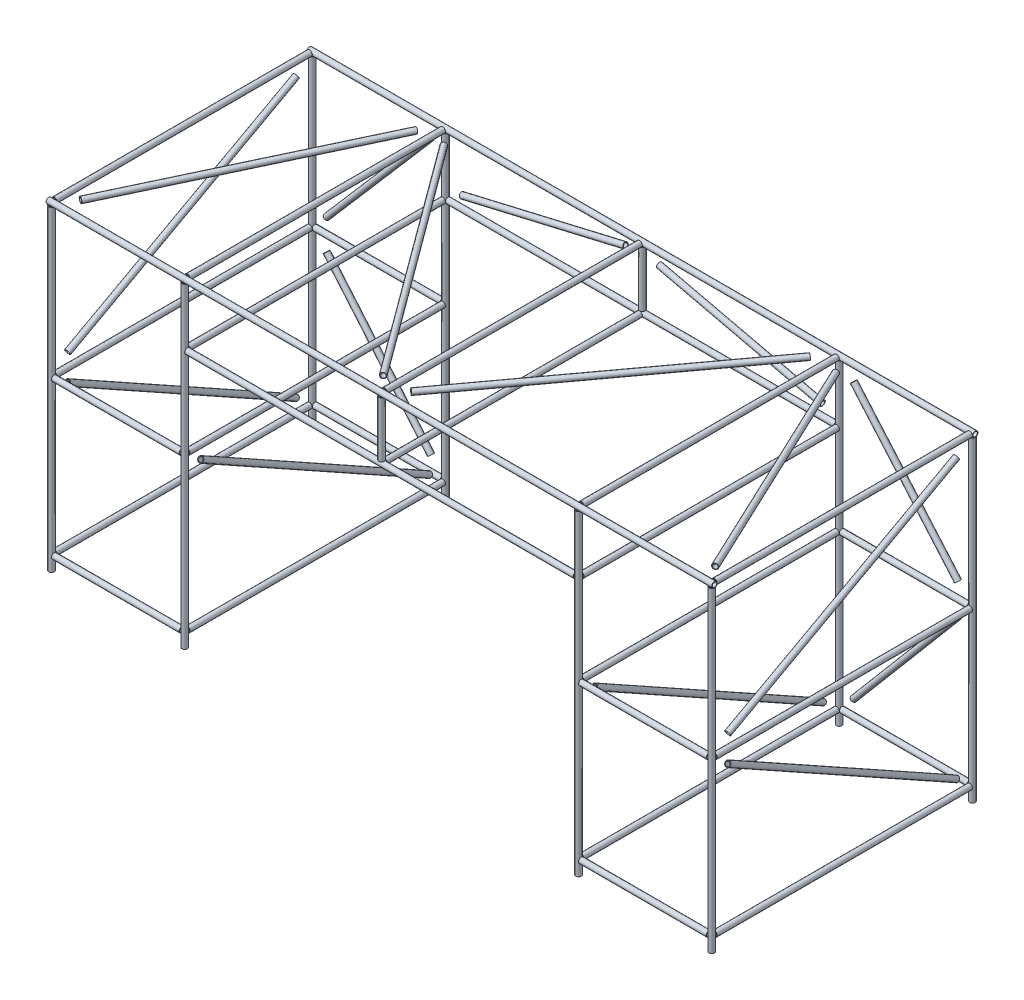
from build123d import *

# Parameters (mm, degrees)
SKETCH1_R                   = 6.35
SKETCH1_R_2                 = 5.08
STRUCTURAL_MEMBER1_DEPTH    = 1524
SKETCH1_ON_SEGMENT_2_R      = 6.35
SKETCH1_ON_SEGMENT_2_R_2    = 5.08
STRUCTURAL_MEMBER1_2_DEPTH  = 1524
SKETCH11_R                  = 6.35
SKETCH11_R_2                = 5.08
STRUCTURAL_MEMBER2_DEPTH    = 584.2
SKETCH11_ON_SEGMENT_2_R     = 6.35
SKETCH11_ON_SEGMENT_2_R_2   = 5.08
STRUCTURAL_MEMBER2_2_DEPTH  = 584.2
SKETCH11_ON_SEGMENT_3_R     = 6.35
SKETCH11_ON_SEGMENT_3_R_2   = 5.08
STRUCTURAL_MEMBER2_3_DEPTH  = 584.2
SKETCH11_ON_SEGMENT_4_R     = 6.35
SKETCH11_ON_SEGMENT_4_R_2   = 5.08
STRUCTURAL_MEMBER2_4_DEPTH  = 584.2
SKETCH11_ON_SEGMENT_5_R     = 6.35
SKETCH11_ON_SEGMENT_5_R_2   = 5.08
STRUCTURAL_MEMBER2_5_DEPTH  = 584.2
TOP_COUNT                   = 2
TOP_PITCH                   = 139.7
SKETCH110_R                 = 6.35
SKETCH110_R_2               = 5.08
STRUCTURAL_MEMBER7_DEPTH    = 889
SKETCH110_ON_SEGMENT_2_R    = 6.35
SKETCH110_ON_SEGMENT_2_R_2  = 5.08
STRUCTURAL_MEMBER7_2_DEPTH  = 889
SKETCH13_R                  = 6.35
SKETCH13_R_2                = 5.08
STRUCTURAL_MEMBER3_DEPTH    = 723.9
SKETCH13_ON_SEGMENT_2_R     = 6.35
SKETCH13_ON_SEGMENT_2_R_2   = 5.08
STRUCTURAL_MEMBER3_2_DEPTH  = 723.9
SKETCH13_ON_SEGMENT_3_R     = 6.35
SKETCH13_ON_SEGMENT_3_R_2   = 5.08
STRUCTURAL_MEMBER3_3_DEPTH  = 723.9
SKETCH13_ON_SEGMENT_4_R     = 6.35
SKETCH13_ON_SEGMENT_4_R_2   = 5.08
STRUCTURAL_MEMBER3_4_DEPTH  = 723.9
SKETCH13_ON_SEGMENT_5_R     = 6.35
SKETCH13_ON_SEGMENT_5_R_2   = 5.08
STRUCTURAL_MEMBER3_5_DEPTH  = 127
SKETCH13_ON_SEGMENT_6_R     = 6.35
SKETCH13_ON_SEGMENT_6_R_2   = 5.08
STRUCTURAL_MEMBER3_6_DEPTH  = 292.1
SKETCH13_ON_SEGMENT_7_R     = 6.35
SKETCH13_ON_SEGMENT_7_R_2   = 5.08
STRUCTURAL_MEMBER3_7_DEPTH  = 292.1
LEGS_COUNT                  = 2
LEGS_PITCH                  = 596.9
SKETCH14_R                  = 6.35
SKETCH14_R_2                = 5.08
STRUCTURAL_MEMBER4_DEPTH    = 584.2
SKETCH14_ON_SEGMENT_2_R     = 6.35
SKETCH14_ON_SEGMENT_2_R_2   = 5.08
STRUCTURAL_MEMBER4_2_DEPTH  = 584.2
SKETCH14_ON_SEGMENT_3_R     = 6.35
SKETCH14_ON_SEGMENT_3_R_2   = 5.08
STRUCTURAL_MEMBER4_3_DEPTH  = 584.2
SKETCH14_ON_SEGMENT_4_R     = 6.35
SKETCH14_ON_SEGMENT_4_R_2   = 5.08
STRUCTURAL_MEMBER4_4_DEPTH  = 584.2
SKETCH14_ON_SEGMENT_5_R     = 6.35
SKETCH14_ON_SEGMENT_5_R_2   = 5.08
STRUCTURAL_MEMBER4_5_DEPTH  = 584.2
SKETCH14_ON_SEGMENT_6_R     = 6.35
SKETCH14_ON_SEGMENT_6_R_2   = 5.08
STRUCTURAL_MEMBER4_6_DEPTH  = 584.2
SKETCH14_ON_SEGMENT_7_R     = 6.35
SKETCH14_ON_SEGMENT_7_R_2   = 5.08
STRUCTURAL_MEMBER4_7_DEPTH  = 584.2
SKETCH14_ON_SEGMENT_8_R     = 6.35
SKETCH14_ON_SEGMENT_8_R_2   = 5.08
STRUCTURAL_MEMBER4_8_DEPTH  = 584.2
SKETCH14_ON_SEGMENT_9_R     = 6.35
SKETCH14_ON_SEGMENT_9_R_2   = 5.08
STRUCTURAL_MEMBER4_9_DEPTH  = 292.1
SKETCH14_ON_SEGMENT_10_R    = 6.35
SKETCH14_ON_SEGMENT_10_R_2  = 5.08
STRUCTURAL_MEMBER4_10_DEPTH = 292.1
SKETCH14_ON_SEGMENT_11_R    = 6.35
SKETCH14_ON_SEGMENT_11_R_2  = 5.08
STRUCTURAL_MEMBER4_11_DEPTH = 292.1
SKETCH14_ON_SEGMENT_12_R    = 6.35
SKETCH14_ON_SEGMENT_12_R_2  = 5.08
STRUCTURAL_MEMBER4_12_DEPTH = 292.1
SKETCH18_R                  = 6.35
SKETCH18_R_2                = 5.08
STRUCTURAL_MEMBER6_DEPTH    = 599.474745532
SKETCH18_ON_SEGMENT_2_R     = 6.35
SKETCH18_ON_SEGMENT_2_R_2   = 5.08
STRUCTURAL_MEMBER6_2_DEPTH  = 599.474745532
SKETCH18_ON_SEGMENT_3_R     = 6.35
SKETCH18_ON_SEGMENT_3_R_2   = 5.08
STRUCTURAL_MEMBER6_3_DEPTH  = 652.809397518
SKETCH18_ON_SEGMENT_4_R     = 6.35
SKETCH18_ON_SEGMENT_4_R_2   = 5.08
STRUCTURAL_MEMBER6_4_DEPTH  = 652.809397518
SKETCH18_ON_SEGMENT_5_R     = 6.35
SKETCH18_ON_SEGMENT_5_R_2   = 5.08
STRUCTURAL_MEMBER6_5_DEPTH  = 577.703443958
SKETCH18_ON_SEGMENT_6_R     = 6.35
SKETCH18_ON_SEGMENT_6_R_2   = 5.08
STRUCTURAL_MEMBER6_6_DEPTH  = 577.703443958
SKETCH18_ON_SEGMENT_7_R     = 6.35
SKETCH18_ON_SEGMENT_7_R_2   = 5.08
STRUCTURAL_MEMBER6_7_DEPTH  = 596.407234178
SKETCH18_ON_SEGMENT_8_R     = 6.35
SKETCH18_ON_SEGMENT_8_R_2   = 5.08
STRUCTURAL_MEMBER6_8_DEPTH  = 596.407234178
SKETCH17_R                  = 6.35
SKETCH17_R_2                = 5.08
STRUCTURAL_MEMBER5_DEPTH    = 384.39289211
SKETCH17_ON_SEGMENT_2_R     = 6.35
SKETCH17_ON_SEGMENT_2_R_2   = 5.08
STRUCTURAL_MEMBER5_2_DEPTH  = 384.39289211
SKETCH116_R                 = 6.35
SKETCH116_R_2               = 5.08
STRUCTURAL_MEMBER8_DEPTH    = 599.474745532
SKETCH116_ON_SEGMENT_2_R    = 6.35
SKETCH116_ON_SEGMENT_2_R_2  = 5.08
STRUCTURAL_MEMBER8_2_DEPTH  = 599.474745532
SKETCH116_ON_SEGMENT_3_R    = 6.35
SKETCH116_ON_SEGMENT_3_R_2  = 5.08
STRUCTURAL_MEMBER8_3_DEPTH  = 365.426687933
SKETCH116_ON_SEGMENT_4_R    = 6.35
SKETCH116_ON_SEGMENT_4_R_2  = 5.08
STRUCTURAL_MEMBER8_4_DEPTH  = 370.2549969
SKETCH116_ON_SEGMENT_5_R    = 6.35
SKETCH116_ON_SEGMENT_5_R_2  = 5.08
STRUCTURAL_MEMBER8_5_DEPTH  = 370.2549969
SKETCH116_ON_SEGMENT_6_R    = 6.35
SKETCH116_ON_SEGMENT_6_R_2  = 5.08
STRUCTURAL_MEMBER8_6_DEPTH  = 365.426687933


with BuildPart() as part:
    # Sketch1 → Structural Member1 (new body)
    with BuildSketch(Plane(origin=(-762, 0, 298.45), x_dir=(0, 0, -1), z_dir=(1, 0, 0))):
        Circle(SKETCH1_R)
        Circle(SKETCH1_R_2, mode=Mode.SUBTRACT)
    extrude(amount=STRUCTURAL_MEMBER1_DEPTH)


with BuildPart() as body_2:
    # Sketch1 on segment 2 (on carried to segment 2) → Structural Member1 2 (new body)
    with BuildSketch(Plane(origin=(-762, 0, -298.45), x_dir=(0, 0, -1), z_dir=(1, 0, 0))):
        Circle(SKETCH1_ON_SEGMENT_2_R)
        Circle(SKETCH1_ON_SEGMENT_2_R_2, mode=Mode.SUBTRACT)
    extrude(amount=STRUCTURAL_MEMBER1_2_DEPTH)


with BuildPart() as body_3:
    # Sketch11 → Structural Member2 (new body)
    with BuildSketch(Plane(origin=(-755.65, 0, -292.1), x_dir=(1, 0, 0), z_dir=(0, 0, 1))):
        Circle(SKETCH11_R)
        Circle(SKETCH11_R_2, mode=Mode.SUBTRACT)
    extrude(amount=STRUCTURAL_MEMBER2_DEPTH)


with BuildPart() as body_4:
    # Sketch11 on segment 2 (on carried to segment 2) → Structural Member2 2 (new body)
    with BuildSketch(Plane(origin=(-450.85, 0, -292.1), x_dir=(1, 0, 0), z_dir=(0, 0, 1))):
        Circle(SKETCH11_ON_SEGMENT_2_R)
        Circle(SKETCH11_ON_SEGMENT_2_R_2, mode=Mode.SUBTRACT)
    extrude(amount=STRUCTURAL_MEMBER2_2_DEPTH)


with BuildPart() as body_5:
    # Sketch11 on segment 3 (on carried to segment 3) → Structural Member2 3 (new body)
    with BuildSketch(Plane.XY.offset(-292.1)):
        Circle(SKETCH11_ON_SEGMENT_3_R)
        Circle(SKETCH11_ON_SEGMENT_3_R_2, mode=Mode.SUBTRACT)
    extrude(amount=STRUCTURAL_MEMBER2_3_DEPTH)


with BuildPart() as body_6:
    # Sketch11 on segment 4 (on carried to segment 4) → Structural Member2 4 (new body)
    with BuildSketch(Plane(origin=(450.85, 0, -292.1), x_dir=(1, 0, 0), z_dir=(0, 0, 1))):
        Circle(SKETCH11_ON_SEGMENT_4_R)
        Circle(SKETCH11_ON_SEGMENT_4_R_2, mode=Mode.SUBTRACT)
    extrude(amount=STRUCTURAL_MEMBER2_4_DEPTH)


with BuildPart() as body_7:
    # Sketch11 on segment 5 (on carried to segment 5) → Structural Member2 5 (new body)
    with BuildSketch(Plane(origin=(755.65, 0, -292.1), x_dir=(1, 0, 0), z_dir=(0, 0, 1))):
        Circle(SKETCH11_ON_SEGMENT_5_R)
        Circle(SKETCH11_ON_SEGMENT_5_R_2, mode=Mode.SUBTRACT)
    extrude(amount=STRUCTURAL_MEMBER2_5_DEPTH)


with BuildPart() as top_1:
    # Top: pattern copy
    add(body_6.part.moved(Location(Vector(0, -1, 0) * (1 * TOP_PITCH))))


with BuildPart() as top_2:
    # Top: pattern copy
    add(body_5.part.moved(Location(Vector(0, -1, 0) * (1 * TOP_PITCH))))


with BuildPart() as top_3:
    # Top: pattern copy
    add(body_4.part.moved(Location(Vector(0, -1, 0) * (1 * TOP_PITCH))))


with BuildPart() as body_11:
    # Sketch110 → Structural Member7 (new body)
    with BuildSketch(Plane(origin=(444.5, -139.7, -298.45), x_dir=(0, 0, 1), z_dir=(-1, 0, 0))):
        Circle(SKETCH110_R)
        Circle(SKETCH110_R_2, mode=Mode.SUBTRACT)
    extrude(amount=STRUCTURAL_MEMBER7_DEPTH)


with BuildPart() as body_12:
    # Sketch110 on segment 2 (on carried to segment 2) → Structural Member7 2 (new body)
    with BuildSketch(Plane(origin=(444.5, -139.7, 298.45), x_dir=(0, 0, 1), z_dir=(-1, 0, 0))):
        Circle(SKETCH110_ON_SEGMENT_2_R)
        Circle(SKETCH110_ON_SEGMENT_2_R_2, mode=Mode.SUBTRACT)
    extrude(amount=STRUCTURAL_MEMBER7_2_DEPTH)


with BuildPart() as body_13:
    # Sketch13 → Structural Member3 (new body)
    with BuildSketch(Plane(origin=(-755.65, -6.35, 298.45), x_dir=(1, 0, 0), z_dir=(0, -1, 0))):
        Circle(SKETCH13_R)
        Circle(SKETCH13_R_2, mode=Mode.SUBTRACT)
    extrude(amount=STRUCTURAL_MEMBER3_DEPTH)


with BuildPart() as body_14:
    # Sketch13 on segment 2 (on carried to segment 2) → Structural Member3 2 (new body)
    with BuildSketch(Plane(origin=(-450.85, -6.35, 298.45), x_dir=(1, 0, 0), z_dir=(0, -1, 0))):
        Circle(SKETCH13_ON_SEGMENT_2_R)
        Circle(SKETCH13_ON_SEGMENT_2_R_2, mode=Mode.SUBTRACT)
    extrude(amount=STRUCTURAL_MEMBER3_2_DEPTH)


with BuildPart() as body_15:
    # Sketch13 on segment 3 (on carried to segment 3) → Structural Member3 3 (new body)
    with BuildSketch(Plane(origin=(450.85, -6.35, 298.45), x_dir=(1, 0, 0), z_dir=(0, -1, 0))):
        Circle(SKETCH13_ON_SEGMENT_3_R)
        Circle(SKETCH13_ON_SEGMENT_3_R_2, mode=Mode.SUBTRACT)
    extrude(amount=STRUCTURAL_MEMBER3_3_DEPTH)


with BuildPart() as body_16:
    # Sketch13 on segment 4 (on carried to segment 4) → Structural Member3 4 (new body)
    with BuildSketch(Plane(origin=(755.65, -6.35, 298.45), x_dir=(1, 0, 0), z_dir=(0, -1, 0))):
        Circle(SKETCH13_ON_SEGMENT_4_R)
        Circle(SKETCH13_ON_SEGMENT_4_R_2, mode=Mode.SUBTRACT)
    extrude(amount=STRUCTURAL_MEMBER3_4_DEPTH)


with BuildPart() as body_17:
    # Sketch13 on segment 5 (on carried to segment 5) → Structural Member3 5 (new body)
    with BuildSketch(Plane(origin=(0, -6.35, 298.45), x_dir=(1, 0, 0), z_dir=(0, -1, 0))):
        Circle(SKETCH13_ON_SEGMENT_5_R)
        Circle(SKETCH13_ON_SEGMENT_5_R_2, mode=Mode.SUBTRACT)
    extrude(amount=STRUCTURAL_MEMBER3_5_DEPTH)


with BuildPart() as body_18:
    # Sketch13 on segment 6 (on carried to segment 6) → Structural Member3 6 (new body)
    with BuildSketch(Plane(origin=(-749.3, -698.5, 298.45), x_dir=(0, 1, 0), z_dir=(1, 0, 0))):
        Circle(SKETCH13_ON_SEGMENT_6_R)
        Circle(SKETCH13_ON_SEGMENT_6_R_2, mode=Mode.SUBTRACT)
    extrude(amount=STRUCTURAL_MEMBER3_6_DEPTH)


with BuildPart() as body_19:
    # Sketch13 on segment 7 (on carried to segment 7) → Structural Member3 7 (new body)
    with BuildSketch(Plane(origin=(457.2, -698.5, 298.45), x_dir=(0, 1, 0), z_dir=(1, 0, 0))):
        Circle(SKETCH13_ON_SEGMENT_7_R)
        Circle(SKETCH13_ON_SEGMENT_7_R_2, mode=Mode.SUBTRACT)
    extrude(amount=STRUCTURAL_MEMBER3_7_DEPTH)


with BuildPart() as legs_1:
    # Legs: pattern copy
    add(body_13.part.moved(Location(Vector(0, 0, -1) * (1 * LEGS_PITCH))))


with BuildPart() as legs_2:
    # Legs: pattern copy
    add(body_17.part.moved(Location(Vector(0, 0, -1) * (1 * LEGS_PITCH))))


with BuildPart() as legs_3:
    # Legs: pattern copy
    add(body_16.part.moved(Location(Vector(0, 0, -1) * (1 * LEGS_PITCH))))


with BuildPart() as legs_4:
    # Legs: pattern copy
    add(body_15.part.moved(Location(Vector(0, 0, -1) * (1 * LEGS_PITCH))))


with BuildPart() as legs_5:
    # Legs: pattern copy
    add(body_14.part.moved(Location(Vector(0, 0, -1) * (1 * LEGS_PITCH))))


with BuildPart() as legs_6:
    # Legs: pattern copy
    add(body_18.part.moved(Location(Vector(0, 0, -1) * (1 * LEGS_PITCH))))


with BuildPart() as legs_7:
    # Legs: pattern copy
    add(body_19.part.moved(Location(Vector(0, 0, -1) * (1 * LEGS_PITCH))))


with BuildPart() as body_27:
    # Sketch14 → Structural Member4 (new body)
    with BuildSketch(Plane(origin=(755.65, -698.5, 292.1), x_dir=(-1, 0, 0), z_dir=(0, 0, -1))):
        Circle(SKETCH14_R)
        Circle(SKETCH14_R_2, mode=Mode.SUBTRACT)
    extrude(amount=STRUCTURAL_MEMBER4_DEPTH)


with BuildPart() as body_28:
    # Sketch14 on segment 2 (on carried to segment 2) → Structural Member4 2 (new body)
    with BuildSketch(Plane(origin=(450.85, -698.5, 292.1), x_dir=(-1, 0, 0), z_dir=(0, 0, -1))):
        Circle(SKETCH14_ON_SEGMENT_2_R)
        Circle(SKETCH14_ON_SEGMENT_2_R_2, mode=Mode.SUBTRACT)
    extrude(amount=STRUCTURAL_MEMBER4_2_DEPTH)


with BuildPart() as body_29:
    # Sketch14 on segment 3 (on carried to segment 3) → Structural Member4 3 (new body)
    with BuildSketch(Plane(origin=(-450.85, -698.5, 292.1), x_dir=(-1, 0, 0), z_dir=(0, 0, -1))):
        Circle(SKETCH14_ON_SEGMENT_3_R)
        Circle(SKETCH14_ON_SEGMENT_3_R_2, mode=Mode.SUBTRACT)
    extrude(amount=STRUCTURAL_MEMBER4_3_DEPTH)


with BuildPart() as body_30:
    # Sketch14 on segment 4 (on carried to segment 4) → Structural Member4 4 (new body)
    with BuildSketch(Plane(origin=(-755.65, -698.5, 292.1), x_dir=(-1, 0, 0), z_dir=(0, 0, -1))):
        Circle(SKETCH14_ON_SEGMENT_4_R)
        Circle(SKETCH14_ON_SEGMENT_4_R_2, mode=Mode.SUBTRACT)
    extrude(amount=STRUCTURAL_MEMBER4_4_DEPTH)


with BuildPart() as body_31:
    # Sketch14 on segment 5 (on carried to segment 5) → Structural Member4 5 (new body)
    with BuildSketch(Plane(origin=(755.65, -346.075, 292.1), x_dir=(-1, 0, 0), z_dir=(0, 0, -1))):
        Circle(SKETCH14_ON_SEGMENT_5_R)
        Circle(SKETCH14_ON_SEGMENT_5_R_2, mode=Mode.SUBTRACT)
    extrude(amount=STRUCTURAL_MEMBER4_5_DEPTH)


with BuildPart() as body_32:
    # Sketch14 on segment 6 (on carried to segment 6) → Structural Member4 6 (new body)
    with BuildSketch(Plane(origin=(450.85, -346.075, 292.1), x_dir=(-1, 0, 0), z_dir=(0, 0, -1))):
        Circle(SKETCH14_ON_SEGMENT_6_R)
        Circle(SKETCH14_ON_SEGMENT_6_R_2, mode=Mode.SUBTRACT)
    extrude(amount=STRUCTURAL_MEMBER4_6_DEPTH)


with BuildPart() as body_33:
    # Sketch14 on segment 7 (on carried to segment 7) → Structural Member4 7 (new body)
    with BuildSketch(Plane(origin=(-450.85, -346.075, 292.1), x_dir=(-1, 0, 0), z_dir=(0, 0, -1))):
        Circle(SKETCH14_ON_SEGMENT_7_R)
        Circle(SKETCH14_ON_SEGMENT_7_R_2, mode=Mode.SUBTRACT)
    extrude(amount=STRUCTURAL_MEMBER4_7_DEPTH)


with BuildPart() as body_34:
    # Sketch14 on segment 8 (on carried to segment 8) → Structural Member4 8 (new body)
    with BuildSketch(Plane(origin=(-755.65, -346.075, 292.1), x_dir=(-1, 0, 0), z_dir=(0, 0, -1))):
        Circle(SKETCH14_ON_SEGMENT_8_R)
        Circle(SKETCH14_ON_SEGMENT_8_R_2, mode=Mode.SUBTRACT)
    extrude(amount=STRUCTURAL_MEMBER4_8_DEPTH)


with BuildPart() as body_35:
    # Sketch14 on segment 9 (on carried to segment 9) → Structural Member4 9 (new body)
    with BuildSketch(Plane(origin=(-457.2, -346.075, 298.45), x_dir=(0, 0, 1), z_dir=(-1, 0, 0))):
        Circle(SKETCH14_ON_SEGMENT_9_R)
        Circle(SKETCH14_ON_SEGMENT_9_R_2, mode=Mode.SUBTRACT)
    extrude(amount=STRUCTURAL_MEMBER4_9_DEPTH)


with BuildPart() as body_36:
    # Sketch14 on segment 10 (on carried to segment 10) → Structural Member4 10 (new body)
    with BuildSketch(Plane(origin=(-749.3, -346.075, -298.45), x_dir=(0, 0, -1), z_dir=(1, 0, 0))):
        Circle(SKETCH14_ON_SEGMENT_10_R)
        Circle(SKETCH14_ON_SEGMENT_10_R_2, mode=Mode.SUBTRACT)
    extrude(amount=STRUCTURAL_MEMBER4_10_DEPTH)


with BuildPart() as body_37:
    # Sketch14 on segment 11 (on carried to segment 11) → Structural Member4 11 (new body)
    with BuildSketch(Plane(origin=(457.2, -346.075, -298.45), x_dir=(0, 0, -1), z_dir=(1, 0, 0))):
        Circle(SKETCH14_ON_SEGMENT_11_R)
        Circle(SKETCH14_ON_SEGMENT_11_R_2, mode=Mode.SUBTRACT)
    extrude(amount=STRUCTURAL_MEMBER4_11_DEPTH)


with BuildPart() as body_38:
    # Sketch14 on segment 12 (on carried to segment 12) → Structural Member4 12 (new body)
    with BuildSketch(Plane(origin=(457.2, -346.075, 298.45), x_dir=(0, 0, -1), z_dir=(1, 0, 0))):
        Circle(SKETCH14_ON_SEGMENT_12_R)
        Circle(SKETCH14_ON_SEGMENT_12_R_2, mode=Mode.SUBTRACT)
    extrude(amount=STRUCTURAL_MEMBER4_12_DEPTH)


with BuildPart() as body_39:
    # Sketch18 → Structural Member6 (new body)
    with BuildSketch(Plane(origin=(-755.65, -376.339066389, 261.804406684), x_dir=(0, 0.8734459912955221, -0.4869210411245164), z_dir=(0, -0.4869210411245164, -0.8734459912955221))):
        Circle(SKETCH18_R)
        Circle(SKETCH18_R_2, mode=Mode.SUBTRACT)
    extrude(amount=STRUCTURAL_MEMBER6_DEPTH)


with BuildPart() as body_40:
    # Sketch18 on segment 2 (on carried to segment 2) → Structural Member6 2 (new body)
    with BuildSketch(Plane(origin=(755.65, -376.339066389, 261.804406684), x_dir=(0, 0.873445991, -0.486921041), z_dir=(0, -0.486921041, -0.873445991))):
        Circle(SKETCH18_ON_SEGMENT_2_R)
        Circle(SKETCH18_ON_SEGMENT_2_R_2, mode=Mode.SUBTRACT)
    extrude(amount=STRUCTURAL_MEMBER6_2_DEPTH)


with BuildPart() as body_41:
    # Sketch18 on segment 3 (on carried to segment 3) → Structural Member6 3 (new body)
    with BuildSketch(Plane(origin=(-418.841715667, 0, -262.92584786), x_dir=(0.78408694, 0.2291504, -0.576799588), z_dir=(0.592567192, 0, 0.805521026))):
        Circle(SKETCH18_ON_SEGMENT_3_R)
        Circle(SKETCH18_ON_SEGMENT_3_R_2, mode=Mode.SUBTRACT)
    extrude(amount=STRUCTURAL_MEMBER6_3_DEPTH)


with BuildPart() as body_42:
    # Sketch18 on segment 4 (on carried to segment 4) → Structural Member6 4 (new body)
    with BuildSketch(Plane(origin=(418.841715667, 0, -262.92584786), x_dir=(-0.78408694, 0.2291504, -0.576799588), z_dir=(-0.592567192, 0, 0.805521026))):
        Circle(SKETCH18_ON_SEGMENT_4_R)
        Circle(SKETCH18_ON_SEGMENT_4_R_2, mode=Mode.SUBTRACT)
    extrude(amount=STRUCTURAL_MEMBER6_4_DEPTH)


with BuildPart() as body_43:
    # Sketch18 on segment 5 (on carried to segment 5) → Structural Member6 5 (new body)
    with BuildSketch(Plane(origin=(-480.113175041, 0, -261.290335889), x_dir=(-0.894574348, -0.148344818, -0.421581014), z_dir=(-0.426297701, 0, 0.904582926))):
        Circle(SKETCH18_ON_SEGMENT_5_R)
        Circle(SKETCH18_ON_SEGMENT_5_R_2, mode=Mode.SUBTRACT)
    extrude(amount=STRUCTURAL_MEMBER6_5_DEPTH)


with BuildPart() as body_44:
    # Sketch18 on segment 6 (on carried to segment 6) → Structural Member6 6 (new body)
    with BuildSketch(Plane(origin=(480.113175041, 0, -261.290335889), x_dir=(0.894574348, -0.148344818, -0.421581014), z_dir=(0.426297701, 0, 0.904582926))):
        Circle(SKETCH18_ON_SEGMENT_6_R)
        Circle(SKETCH18_ON_SEGMENT_6_R_2, mode=Mode.SUBTRACT)
    extrude(amount=STRUCTURAL_MEMBER6_6_DEPTH)


with BuildPart() as body_45:
    # Sketch18 on segment 7 (on carried to segment 7) → Structural Member6 7 (new body)
    with BuildSketch(Plane(origin=(-755.65, -30.136683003, -261.734127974), x_dir=(0, -0.877702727, -0.479205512), z_dir=(0, -0.479205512, 0.877702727))):
        Circle(SKETCH18_ON_SEGMENT_7_R)
        Circle(SKETCH18_ON_SEGMENT_7_R_2, mode=Mode.SUBTRACT)
    extrude(amount=STRUCTURAL_MEMBER6_7_DEPTH)


with BuildPart() as body_46:
    # Sketch18 on segment 8 (on carried to segment 8) → Structural Member6 8 (new body)
    with BuildSketch(Plane(origin=(755.65, -30.136683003, -261.734127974), x_dir=(0, -0.877702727, -0.479205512), z_dir=(0, -0.479205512, 0.877702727))):
        Circle(SKETCH18_ON_SEGMENT_8_R)
        Circle(SKETCH18_ON_SEGMENT_8_R_2, mode=Mode.SUBTRACT)
    extrude(amount=STRUCTURAL_MEMBER6_8_DEPTH)


with BuildPart() as body_47:
    # Sketch17 → Structural Member5 (new body)
    with BuildSketch(Plane(origin=(412.550594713, -113.707561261, -298.45), x_dir=(0.22819132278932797, 0.9736163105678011, 0), z_dir=(-0.9736163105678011, 0.22819132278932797, 0))):
        Circle(SKETCH17_R)
        Circle(SKETCH17_R_2, mode=Mode.SUBTRACT)
    extrude(amount=STRUCTURAL_MEMBER5_DEPTH)


with BuildPart() as body_48:
    # Sketch17 on segment 2 (on carried to segment 2) → Structural Member5 2 (new body)
    with BuildSketch(Plane(origin=(-38.299405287, -25.992438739, -298.45), x_dir=(-0.228191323, 0.973616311, 0), z_dir=(-0.973616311, -0.228191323, 0))):
        Circle(SKETCH17_ON_SEGMENT_2_R)
        Circle(SKETCH17_ON_SEGMENT_2_R_2, mode=Mode.SUBTRACT)
    extrude(amount=STRUCTURAL_MEMBER5_2_DEPTH)


with BuildPart() as body_49:
    # Sketch116 → Structural Member8 (new body)
    with BuildSketch(Plane(origin=(450.85, -376.339066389, 261.804406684), x_dir=(0, 0.8734459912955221, -0.48692104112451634), z_dir=(0, -0.48692104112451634, -0.8734459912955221))):
        Circle(SKETCH116_R)
        Circle(SKETCH116_R_2, mode=Mode.SUBTRACT)
    extrude(amount=STRUCTURAL_MEMBER8_DEPTH)


with BuildPart() as body_50:
    # Sketch116 on segment 2 (on carried to segment 2) → Structural Member8 2 (new body)
    with BuildSketch(Plane(origin=(-450.85, -376.339066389, 261.804406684), x_dir=(0, 0.873445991, -0.486921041), z_dir=(0, -0.486921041, -0.873445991))):
        Circle(SKETCH116_ON_SEGMENT_2_R)
        Circle(SKETCH116_ON_SEGMENT_2_R_2, mode=Mode.SUBTRACT)
    extrude(amount=STRUCTURAL_MEMBER8_2_DEPTH)


with BuildPart() as body_51:
    # Sketch116 on segment 3 (on carried to segment 3) → Structural Member8 3 (new body)
    with BuildSketch(Plane(origin=(-722.637161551, -311.35189448, -298.45), x_dir=(-0.684252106, 0.590617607, 0.427749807), z_dir=(0.653412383, 0.757002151, 0))):
        Circle(SKETCH116_ON_SEGMENT_3_R)
        Circle(SKETCH116_ON_SEGMENT_3_R_2, mode=Mode.SUBTRACT)
    extrude(amount=STRUCTURAL_MEMBER8_3_DEPTH)


with BuildPart() as body_52:
    # Sketch116 on segment 4 (on carried to segment 4) → Structural Member8 4 (new body)
    with BuildSketch(Plane(origin=(-722.766321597, -380.908436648, -298.45), x_dir=(0.313905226, 0.265363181, -0.911617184), z_dir=(0.645589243, -0.763684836, 0))):
        Circle(SKETCH116_ON_SEGMENT_4_R)
        Circle(SKETCH116_ON_SEGMENT_4_R_2, mode=Mode.SUBTRACT)
    extrude(amount=STRUCTURAL_MEMBER8_4_DEPTH)


with BuildPart() as body_53:
    # Sketch116 on segment 5 (on carried to segment 5) → Structural Member8 5 (new body)
    with BuildSketch(Plane(origin=(722.766321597, -380.908436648, -298.45), x_dir=(-0.313905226, 0.265363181, -0.911617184), z_dir=(-0.645589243, -0.763684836, 0))):
        Circle(SKETCH116_ON_SEGMENT_5_R)
        Circle(SKETCH116_ON_SEGMENT_5_R_2, mode=Mode.SUBTRACT)
    extrude(amount=STRUCTURAL_MEMBER8_5_DEPTH)


with BuildPart() as body_54:
    # Sketch116 on segment 6 (on carried to segment 6) → Structural Member8 6 (new body)
    with BuildSketch(Plane(origin=(722.637161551, -311.35189448, -298.45), x_dir=(0.684252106, 0.590617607, 0.427749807), z_dir=(-0.653412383, 0.757002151, 0))):
        Circle(SKETCH116_ON_SEGMENT_6_R)
        Circle(SKETCH116_ON_SEGMENT_6_R_2, mode=Mode.SUBTRACT)
    extrude(amount=STRUCTURAL_MEMBER8_6_DEPTH)


solid = Compound([part.part, body_2.part, body_3.part, body_4.part, body_5.part, body_6.part, body_7.part, top_1.part, top_2.part, top_3.part, body_11.part, body_12.part, body_13.part, body_14.part, body_15.part, body_16.part, body_17.part, body_18.part, body_19.part, legs_1.part, legs_2.part, legs_3.part, legs_4.part, legs_5.part, legs_6.part, legs_7.part, body_27.part, body_28.part, body_29.part, body_30.part, body_31.part, body_32.part, body_33.part, body_34.part, body_35.part, body_36.part, body_37.part, body_38.part, body_39.part, body_40.part, body_41.part, body_42.part, body_43.part, body_44.part, body_45.part, body_46.part, body_47.part, body_48.part, body_49.part, body_50.part, body_51.part, body_52.part, body_53.part, body_54.part])
